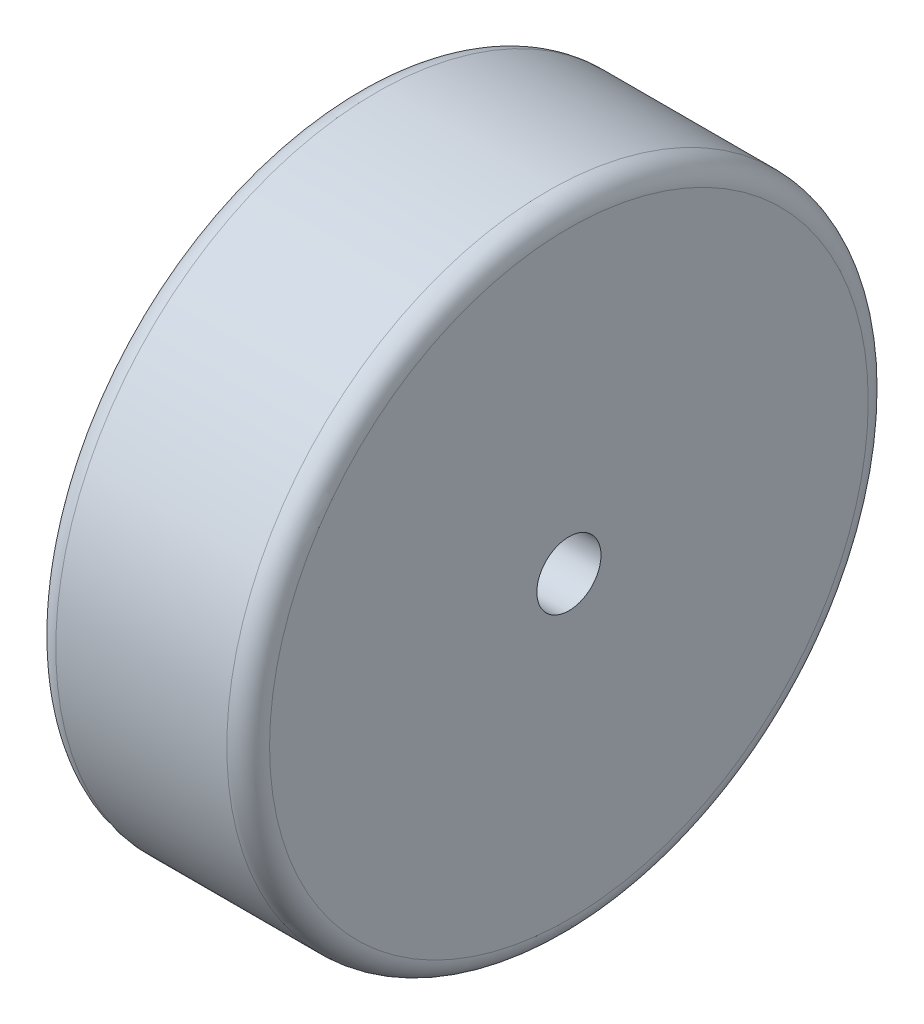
ISO-10303-21;
HEADER;
FILE_DESCRIPTION(('STEP AP214'),'2;1');
FILE_NAME('part.step','',(''),(''),'','','');
FILE_SCHEMA(('AUTOMOTIVE_DESIGN { 1 0 10303 214 1 1 1 1 }'));
ENDSEC;
DATA;
#1=APPLICATION_CONTEXT('core data for automotive mechanical design processes');
#2=APPLICATION_PROTOCOL_DEFINITION('international standard','automotive_design',2000,#1);
#3=PRODUCT_CONTEXT('',#1,'mechanical');
#4=PRODUCT('Part','Part','',(#3));
#5=PRODUCT_RELATED_PRODUCT_CATEGORY('part','',(#4));
#6=PRODUCT_DEFINITION_FORMATION('','',#4);
#7=PRODUCT_DEFINITION_CONTEXT('part definition',#1,'design');
#8=PRODUCT_DEFINITION('design','',#6,#7);
#9=PRODUCT_DEFINITION_SHAPE('','',#8);
#10=(LENGTH_UNIT() NAMED_UNIT(*) SI_UNIT(.MILLI.,.METRE.));
#11=(NAMED_UNIT(*) PLANE_ANGLE_UNIT() SI_UNIT($,.RADIAN.));
#12=(NAMED_UNIT(*) SI_UNIT($,.STERADIAN.) SOLID_ANGLE_UNIT());
#13=UNCERTAINTY_MEASURE_WITH_UNIT(LENGTH_MEASURE(1.E-05),#10,'distance_accuracy_value','');
#14=(GEOMETRIC_REPRESENTATION_CONTEXT(3) GLOBAL_UNCERTAINTY_ASSIGNED_CONTEXT((#13)) GLOBAL_UNIT_ASSIGNED_CONTEXT((#10,
#11,#12)) REPRESENTATION_CONTEXT('',''));
#15=CARTESIAN_POINT('',(0.,0.,0.));
#16=DIRECTION('',(0.,0.,1.));
#17=DIRECTION('',(1.,0.,0.));
#18=AXIS2_PLACEMENT_3D('',#15,#16,#17);
#19=CARTESIAN_POINT('',(50.,165.,0.));
#20=DIRECTION('',(1.,0.,0.));
#21=DIRECTION('',(0.,0.,-1.));
#22=AXIS2_PLACEMENT_3D('',#19,#20,#21);
#23=PLANE('',#22);
#24=CARTESIAN_POINT('',(50.,150.,0.));
#25=DIRECTION('',(1.,0.,0.));
#26=DIRECTION('',(0.,0.,-1.));
#27=AXIS2_PLACEMENT_3D('',#24,#25,#26);
#28=CIRCLE('',#27,140.);
#29=CARTESIAN_POINT('',(50.,150.,-140.));
#30=VERTEX_POINT('',#29);
#31=EDGE_CURVE('E72',#30,#30,#28,.T.);
#32=ORIENTED_EDGE('',*,*,#31,.T.);
#33=EDGE_LOOP('',(#32));
#34=FACE_BOUND('',#33,.T.);
#35=CARTESIAN_POINT('',(50.0000000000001,150.,0.));
#36=DIRECTION('',(1.,0.,0.));
#37=DIRECTION('',(0.,0.,-1.));
#38=AXIS2_PLACEMENT_3D('',#35,#36,#37);
#39=CIRCLE('',#38,15.);
#40=CARTESIAN_POINT('',(50.0000000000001,150.,-15.));
#41=VERTEX_POINT('',#40);
#42=EDGE_CURVE('E10',#41,#41,#39,.T.);
#43=ORIENTED_EDGE('',*,*,#42,.F.);
#44=EDGE_LOOP('',(#43));
#45=FACE_BOUND('',#44,.T.);
#46=ADVANCED_FACE('F43',(#34,#45),#23,.T.);
#47=CARTESIAN_POINT('',(0.,150.,0.));
#48=DIRECTION('',(1.,0.,0.));
#49=DIRECTION('',(0.,0.,-1.));
#50=AXIS2_PLACEMENT_3D('',#47,#48,#49);
#51=CYLINDRICAL_SURFACE('',#50,15.);
#52=ORIENTED_EDGE('',*,*,#42,.T.);
#53=EDGE_LOOP('',(#52));
#54=FACE_BOUND('',#53,.T.);
#55=CARTESIAN_POINT('',(-50.0000000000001,150.,0.));
#56=DIRECTION('',(1.,0.,0.));
#57=DIRECTION('',(0.,0.,-1.));
#58=AXIS2_PLACEMENT_3D('',#55,#56,#57);
#59=CIRCLE('',#58,15.);
#60=CARTESIAN_POINT('',(-50.0000000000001,150.,-15.));
#61=VERTEX_POINT('',#60);
#62=EDGE_CURVE('E50',#61,#61,#59,.T.);
#63=ORIENTED_EDGE('',*,*,#62,.F.);
#64=EDGE_LOOP('',(#63));
#65=FACE_BOUND('',#64,.T.);
#66=ADVANCED_FACE('F92',(#54,#65),#51,.F.);
#67=CARTESIAN_POINT('',(-50.,165.,0.));
#68=DIRECTION('',(-1.,0.,0.));
#69=DIRECTION('',(0.,0.,1.));
#70=AXIS2_PLACEMENT_3D('',#67,#68,#69);
#71=PLANE('',#70);
#72=ORIENTED_EDGE('',*,*,#62,.T.);
#73=EDGE_LOOP('',(#72));
#74=FACE_BOUND('',#73,.T.);
#75=CARTESIAN_POINT('',(-50.,150.,0.));
#76=DIRECTION('',(1.,0.,0.));
#77=DIRECTION('',(0.,0.,-1.));
#78=AXIS2_PLACEMENT_3D('',#75,#76,#77);
#79=CIRCLE('',#78,140.);
#80=CARTESIAN_POINT('',(-50.,150.,-140.));
#81=VERTEX_POINT('',#80);
#82=EDGE_CURVE('E57',#81,#81,#79,.T.);
#83=ORIENTED_EDGE('',*,*,#82,.F.);
#84=EDGE_LOOP('',(#83));
#85=FACE_BOUND('',#84,.T.);
#86=ADVANCED_FACE('F96',(#74,#85),#71,.T.);
#87=CARTESIAN_POINT('',(-40.,150.,0.));
#88=DIRECTION('',(1.,0.,0.));
#89=DIRECTION('',(0.,0.,-1.));
#90=AXIS2_PLACEMENT_3D('',#87,#88,#89);
#91=TOROIDAL_SURFACE('',#90,140.,10.);
#92=ORIENTED_EDGE('',*,*,#82,.T.);
#93=EDGE_LOOP('',(#92));
#94=FACE_BOUND('',#93,.T.);
#95=CARTESIAN_POINT('',(-39.9999999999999,150.,0.));
#96=DIRECTION('',(1.,0.,0.));
#97=DIRECTION('',(0.,0.,-1.));
#98=AXIS2_PLACEMENT_3D('',#95,#96,#97);
#99=CIRCLE('',#98,150.);
#100=CARTESIAN_POINT('',(-39.9999999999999,150.,-150.));
#101=VERTEX_POINT('',#100);
#102=EDGE_CURVE('E64',#101,#101,#99,.T.);
#103=ORIENTED_EDGE('',*,*,#102,.F.);
#104=EDGE_LOOP('',(#103));
#105=FACE_BOUND('',#104,.T.);
#106=ADVANCED_FACE('F88',(#94,#105),#91,.T.);
#107=CARTESIAN_POINT('',(0.,150.,0.));
#108=DIRECTION('',(1.,0.,0.));
#109=DIRECTION('',(0.,0.,-1.));
#110=AXIS2_PLACEMENT_3D('',#107,#108,#109);
#111=CYLINDRICAL_SURFACE('',#110,150.);
#112=ORIENTED_EDGE('',*,*,#102,.T.);
#113=EDGE_LOOP('',(#112));
#114=FACE_BOUND('',#113,.T.);
#115=CARTESIAN_POINT('',(39.9999999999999,150.,0.));
#116=DIRECTION('',(1.,0.,0.));
#117=DIRECTION('',(0.,0.,-1.));
#118=AXIS2_PLACEMENT_3D('',#115,#116,#117);
#119=CIRCLE('',#118,150.);
#120=CARTESIAN_POINT('',(39.9999999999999,150.,-150.));
#121=VERTEX_POINT('',#120);
#122=EDGE_CURVE('E69',#121,#121,#119,.T.);
#123=ORIENTED_EDGE('',*,*,#122,.F.);
#124=EDGE_LOOP('',(#123));
#125=FACE_BOUND('',#124,.T.);
#126=ADVANCED_FACE('F82',(#114,#125),#111,.T.);
#127=CARTESIAN_POINT('',(40.,150.,0.));
#128=DIRECTION('',(1.,0.,0.));
#129=DIRECTION('',(0.,0.,-1.));
#130=AXIS2_PLACEMENT_3D('',#127,#128,#129);
#131=TOROIDAL_SURFACE('',#130,140.,10.);
#132=ORIENTED_EDGE('',*,*,#122,.T.);
#133=EDGE_LOOP('',(#132));
#134=FACE_BOUND('',#133,.T.);
#135=ORIENTED_EDGE('',*,*,#31,.F.);
#136=EDGE_LOOP('',(#135));
#137=FACE_BOUND('',#136,.T.);
#138=ADVANCED_FACE('F80',(#134,#137),#131,.T.);
#139=CLOSED_SHELL('',(#46,#66,#86,#106,#126,#138));
#140=MANIFOLD_SOLID_BREP('B2',#139);
#141=ADVANCED_BREP_SHAPE_REPRESENTATION('',(#18,#140),#14);
#142=SHAPE_DEFINITION_REPRESENTATION(#9,#141);
ENDSEC;
END-ISO-10303-21;
